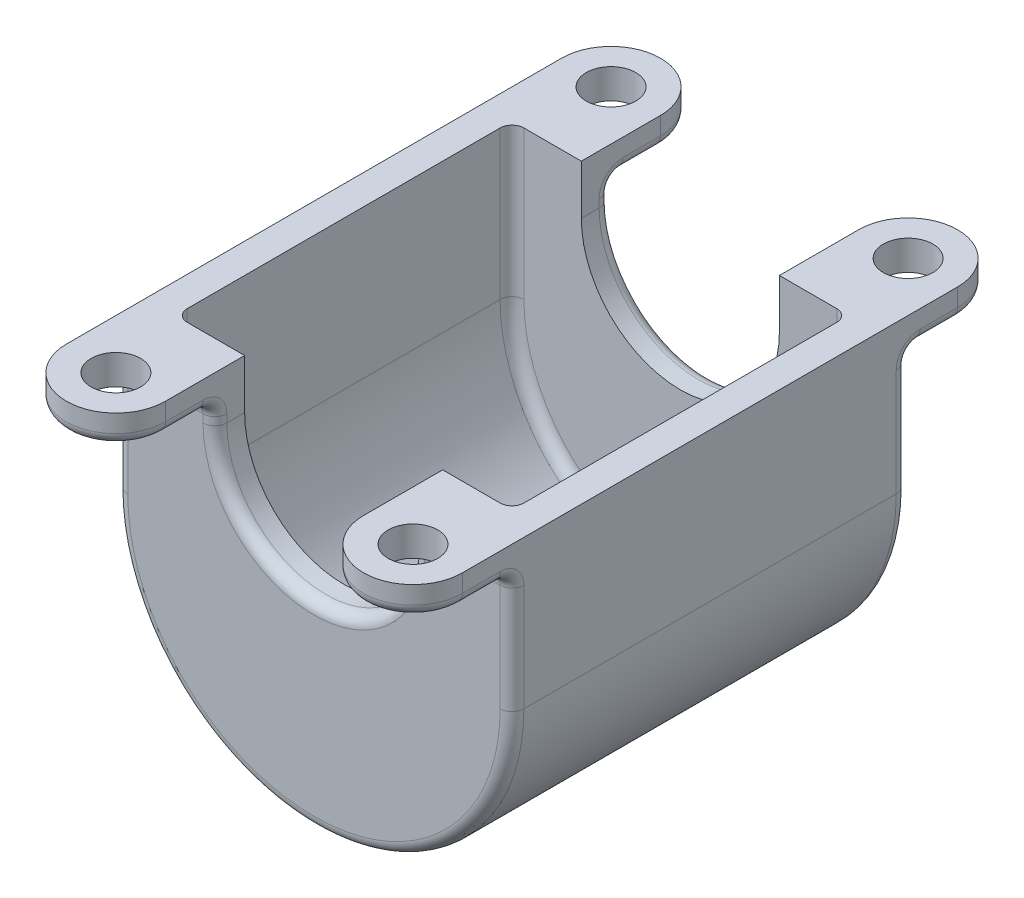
from build123d import *

# Parameters (mm, degrees)
BASE_EXTRUDE_DEPTH  = 50.8
SHELL1_T            = -7.62
SKETCH2_R           = 6.35
BOSS_EXTRUDE1_DEPTH = 7.62
FILLET1_R           = 3.048
FILLET2_R           = 3.048


with BuildPart() as part:
    # Sketch1 → Base-Extrude (new body)
    with BuildSketch(Plane.XY):
        with BuildLine():
            Line((50.8, 0), (25.4, 0))
            Line((25.4, 0), (25.4, -12.7))
            ThreePointArc((25.4, -12.7), (0, -38.1), (-25.4, -12.7))
            Line((-25.4, -12.7), (-25.4, 0))
            Line((-25.4, 0), (-50.8, 0))
            Line((-50.8, 0), (-50.8, -38.1))
            ThreePointArc((-50.8, -38.1), (0, -88.9), (50.8, -38.1))
            Line((50.8, -38.1), (50.8, 0))
        make_face()
    extrude(amount=BASE_EXTRUDE_DEPTH)

    # Shell1
    shell1_openings = [part.faces().sort_by_distance(p)[0] for p in [
        (-25.4, -6.35, 25.4),
        (0, -38.1, 25.4),
        (25.4, -6.35, 25.4),
        (38.1, 0, 25.4),
        (-38.1, 0, 25.4),
        (0, -45.91286254, 0),
    ]]
    offset(amount=SHELL1_T, openings=shell1_openings, kind=Kind.INTERSECTION)

    # Sketch2 → Boss-Extrude1 (add)
    with BuildSketch(Plane(origin=(0, 0, 0), x_dir=(-1, 0, 0), z_dir=(0, 1, 0))):
        with BuildLine():
            Line((25.4, 43.18), (50.8, 43.18))
            Line((50.8, 43.18), (50.8, 63.5))
            ThreePointArc((50.8, 63.5), (38.1, 76.2), (25.4, 63.5))
            Line((25.4, 63.5), (25.4, 43.18))
        make_face()
        with Locations((38.1, 63.5)):
            Circle(SKETCH2_R, mode=Mode.SUBTRACT)
    boss_extrude1 = extrude(amount=-BOSS_EXTRUDE1_DEPTH)

    # Mirror1: Boss-Extrude1 across plane
    add(boss_extrude1.mirror(Plane(origin=(0, 0, 0), x_dir=(0, 0, 1), z_dir=(1, 0, 0))))

    # Boss-Mirror1: part across face


with BuildPart() as part_1:
    add(part.part)
    add(part.part.mirror(Plane(origin=(0, -51.388097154, 0), x_dir=(1, 0, 0), z_dir=(0, 0, -1))))

    # Fillet1
    fillet1_edges = [part_1.edges().sort_by_distance(p)[0] for p in [
        (43.18, -19.05, 43.18),
        (-43.18, -19.05, 43.18),
        (0, -81.28, 43.18),
        (-38.1, -7.62, 50.8),
        (38.1, -7.62, 50.8),
        (43.18, -19.05, -43.18),
        (-43.18, -19.05, -43.18),
        (0, -81.28, -43.18),
        (-38.1, -7.62, -50.8),
        (38.1, -7.62, -50.8),
    ]]
    fillet(fillet1_edges, radius=FILLET1_R)

    # Fillet2
    fillet2_edges = [part_1.edges().sort_by_distance(p)[0] for p in [
        (0, -88.9, 50.8),
        (50.8, -24.384, 50.8),
        (25.4, -11.684, 50.8),
        (-25.4, -11.684, 50.8),
        (-50.8, -24.384, 50.8),
        (25.4, -7.62, 58.674),
        (-25.4, -7.62, 58.674),
        (25.4, -7.62, -58.674),
        (50.8, -24.384, -50.8),
        (-50.8, -24.384, -50.8),
        (-25.4, -11.684, -50.8),
        (25.4, -11.684, -50.8),
        (-25.4, -7.62, -58.674),
        (25.4, -8.512738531, 51.692738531),
        (50.8, -8.512738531, 51.692738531),
        (-50.8, -8.512738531, 51.692738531),
        (-25.4, -8.512738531, 51.692738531),
        (25.4, -8.512738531, -51.692738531),
        (50.8, -8.512738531, -51.692738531),
        (-50.8, -8.512738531, -51.692738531),
        (-25.4, -8.512738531, -51.692738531),
        (0, -38.1, 50.8),
        (-38.1, -7.62, 76.2),
        (-50.8, -7.62, 58.674),
        (38.1, -7.62, 76.2),
        (50.8, -7.62, 58.674),
        (0, -38.1, -50.8),
        (-50.8, -7.62, -58.674),
        (0, -88.9, -50.8),
        (-38.1, -7.62, -76.2),
        (50.8, -7.62, -58.674),
        (38.1, -7.62, -76.2),
    ]]
    fillet(fillet2_edges, radius=FILLET2_R)


solid = part_1.part
